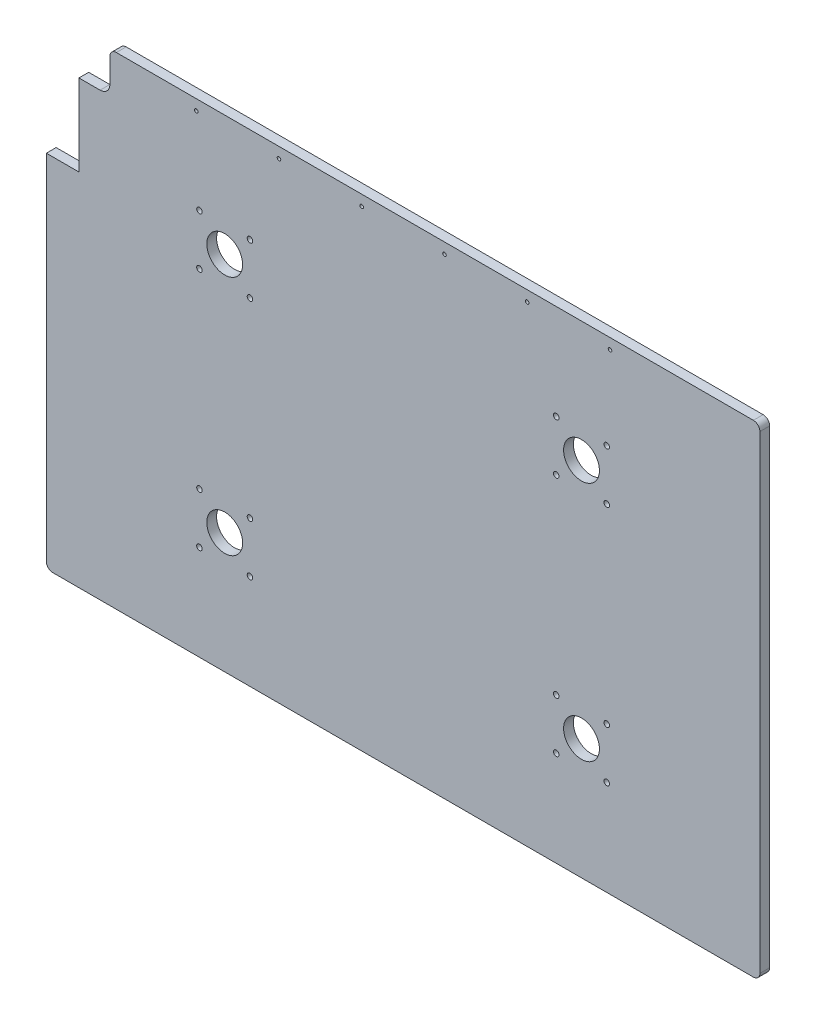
ISO-10303-21;
HEADER;
FILE_DESCRIPTION(('STEP AP214'),'2;1');
FILE_NAME('part.step','',(''),(''),'','','');
FILE_SCHEMA(('AUTOMOTIVE_DESIGN { 1 0 10303 214 1 1 1 1 }'));
ENDSEC;
DATA;
#1=APPLICATION_CONTEXT('core data for automotive mechanical design processes');
#2=APPLICATION_PROTOCOL_DEFINITION('international standard','automotive_design',2000,#1);
#3=PRODUCT_CONTEXT('',#1,'mechanical');
#4=PRODUCT('Part','Part','',(#3));
#5=PRODUCT_RELATED_PRODUCT_CATEGORY('part','',(#4));
#6=PRODUCT_DEFINITION_FORMATION('','',#4);
#7=PRODUCT_DEFINITION_CONTEXT('part definition',#1,'design');
#8=PRODUCT_DEFINITION('design','',#6,#7);
#9=PRODUCT_DEFINITION_SHAPE('','',#8);
#10=(LENGTH_UNIT() NAMED_UNIT(*) SI_UNIT(.MILLI.,.METRE.));
#11=(NAMED_UNIT(*) PLANE_ANGLE_UNIT() SI_UNIT($,.RADIAN.));
#12=(NAMED_UNIT(*) SI_UNIT($,.STERADIAN.) SOLID_ANGLE_UNIT());
#13=UNCERTAINTY_MEASURE_WITH_UNIT(LENGTH_MEASURE(1.E-05),#10,'distance_accuracy_value','');
#14=(GEOMETRIC_REPRESENTATION_CONTEXT(3) GLOBAL_UNCERTAINTY_ASSIGNED_CONTEXT((#13)) GLOBAL_UNIT_ASSIGNED_CONTEXT((#10,
#11,#12)) REPRESENTATION_CONTEXT('',''));
#15=CARTESIAN_POINT('',(0.,0.,0.));
#16=DIRECTION('',(0.,0.,1.));
#17=DIRECTION('',(1.,0.,0.));
#18=AXIS2_PLACEMENT_3D('',#15,#16,#17);
#19=CARTESIAN_POINT('',(-219.,143.5,72.));
#20=DIRECTION('',(0.,-1.,0.));
#21=DIRECTION('',(0.,0.,-1.));
#22=AXIS2_PLACEMENT_3D('',#19,#20,#21);
#23=PLANE('',#22);
#24=DIRECTION('',(-1.,0.,0.));
#25=VECTOR('',#24,1.);
#26=CARTESIAN_POINT('',(-219.,143.5,66.));
#27=LINE('',#26,#25);
#28=CARTESIAN_POINT('',(215.,143.5,66.));
#29=VERTEX_POINT('',#28);
#30=CARTESIAN_POINT('',(-176.,143.5,66.));
#31=VERTEX_POINT('',#30);
#32=EDGE_CURVE('E153',#29,#31,#27,.T.);
#33=ORIENTED_EDGE('',*,*,#32,.T.);
#34=DIRECTION('',(0.,0.,1.));
#35=VECTOR('',#34,1.);
#36=CARTESIAN_POINT('',(-176.,143.5,72.));
#37=LINE('',#36,#35);
#38=CARTESIAN_POINT('',(-176.,143.5,72.));
#39=VERTEX_POINT('',#38);
#40=EDGE_CURVE('E179',#31,#39,#37,.T.);
#41=ORIENTED_EDGE('',*,*,#40,.T.);
#42=DIRECTION('',(-1.,0.,0.));
#43=VECTOR('',#42,1.);
#44=CARTESIAN_POINT('',(-219.,143.5,72.));
#45=LINE('',#44,#43);
#46=CARTESIAN_POINT('',(215.,143.5,72.));
#47=VERTEX_POINT('',#46);
#48=EDGE_CURVE('E167',#47,#39,#45,.T.);
#49=ORIENTED_EDGE('',*,*,#48,.F.);
#50=DIRECTION('',(0.,0.,-1.));
#51=VECTOR('',#50,1.);
#52=CARTESIAN_POINT('',(215.,143.5,72.));
#53=LINE('',#52,#51);
#54=EDGE_CURVE('E170',#47,#29,#53,.T.);
#55=ORIENTED_EDGE('',*,*,#54,.T.);
#56=EDGE_LOOP('',(#33,#41,#49,#55));
#57=FACE_BOUND('',#56,.T.);
#58=ADVANCED_FACE('F35',(#57),#23,.F.);
#59=CARTESIAN_POINT('',(-219.,143.5,72.));
#60=DIRECTION('',(1.,0.,0.));
#61=DIRECTION('',(0.,1.,0.));
#62=AXIS2_PLACEMENT_3D('',#59,#60,#61);
#63=PLANE('',#62);
#64=DIRECTION('',(0.,-1.,0.));
#65=VECTOR('',#64,1.);
#66=CARTESIAN_POINT('',(-219.,143.5,72.));
#67=LINE('',#66,#65);
#68=CARTESIAN_POINT('',(-219.,68.4999999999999,72.));
#69=VERTEX_POINT('',#68);
#70=CARTESIAN_POINT('',(-219.,-148.5,72.));
#71=VERTEX_POINT('',#70);
#72=EDGE_CURVE('E145',#69,#71,#67,.T.);
#73=ORIENTED_EDGE('',*,*,#72,.F.);
#74=DIRECTION('',(0.,0.,1.));
#75=VECTOR('',#74,1.);
#76=CARTESIAN_POINT('',(-219.,68.4999999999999,65.999));
#77=LINE('',#76,#75);
#78=CARTESIAN_POINT('',(-219.,68.4999999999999,66.));
#79=VERTEX_POINT('',#78);
#80=EDGE_CURVE('E131',#79,#69,#77,.T.);
#81=ORIENTED_EDGE('',*,*,#80,.F.);
#82=DIRECTION('',(0.,-1.,0.));
#83=VECTOR('',#82,1.);
#84=CARTESIAN_POINT('',(-219.,143.5,66.));
#85=LINE('',#84,#83);
#86=CARTESIAN_POINT('',(-219.,-148.5,66.));
#87=VERTEX_POINT('',#86);
#88=EDGE_CURVE('E49',#79,#87,#85,.T.);
#89=ORIENTED_EDGE('',*,*,#88,.T.);
#90=DIRECTION('',(0.,0.,-1.));
#91=VECTOR('',#90,1.);
#92=CARTESIAN_POINT('',(-219.,-148.5,72.));
#93=LINE('',#92,#91);
#94=EDGE_CURVE('E11',#87,#71,#93,.F.);
#95=ORIENTED_EDGE('',*,*,#94,.T.);
#96=EDGE_LOOP('',(#73,#81,#89,#95));
#97=FACE_BOUND('',#96,.T.);
#98=ADVANCED_FACE('F149',(#97),#63,.F.);
#99=CARTESIAN_POINT('',(-219.,-152.5,72.));
#100=DIRECTION('',(0.,1.,0.));
#101=DIRECTION('',(0.,0.,1.));
#102=AXIS2_PLACEMENT_3D('',#99,#100,#101);
#103=PLANE('',#102);
#104=DIRECTION('',(1.,0.,0.));
#105=VECTOR('',#104,1.);
#106=CARTESIAN_POINT('',(-219.,-152.5,66.));
#107=LINE('',#106,#105);
#108=CARTESIAN_POINT('',(-215.,-152.5,66.));
#109=VERTEX_POINT('',#108);
#110=CARTESIAN_POINT('',(215.,-152.5,66.));
#111=VERTEX_POINT('',#110);
#112=EDGE_CURVE('E172',#109,#111,#107,.T.);
#113=ORIENTED_EDGE('',*,*,#112,.T.);
#114=DIRECTION('',(0.,0.,-1.));
#115=VECTOR('',#114,1.);
#116=CARTESIAN_POINT('',(215.,-152.5,72.));
#117=LINE('',#116,#115);
#118=CARTESIAN_POINT('',(215.,-152.5,72.));
#119=VERTEX_POINT('',#118);
#120=EDGE_CURVE('E43',#111,#119,#117,.F.);
#121=ORIENTED_EDGE('',*,*,#120,.T.);
#122=DIRECTION('',(1.,0.,0.));
#123=VECTOR('',#122,1.);
#124=CARTESIAN_POINT('',(-219.,-152.5,72.));
#125=LINE('',#124,#123);
#126=CARTESIAN_POINT('',(-215.,-152.5,72.));
#127=VERTEX_POINT('',#126);
#128=EDGE_CURVE('E152',#127,#119,#125,.T.);
#129=ORIENTED_EDGE('',*,*,#128,.F.);
#130=DIRECTION('',(0.,0.,-1.));
#131=VECTOR('',#130,1.);
#132=CARTESIAN_POINT('',(-215.,-152.5,72.));
#133=LINE('',#132,#131);
#134=EDGE_CURVE('E204',#127,#109,#133,.T.);
#135=ORIENTED_EDGE('',*,*,#134,.T.);
#136=EDGE_LOOP('',(#113,#121,#129,#135));
#137=FACE_BOUND('',#136,.T.);
#138=ADVANCED_FACE('F209',(#137),#103,.F.);
#139=CARTESIAN_POINT('',(219.,143.5,72.));
#140=DIRECTION('',(-1.,0.,0.));
#141=DIRECTION('',(0.,-1.,0.));
#142=AXIS2_PLACEMENT_3D('',#139,#140,#141);
#143=PLANE('',#142);
#144=DIRECTION('',(0.,1.,0.));
#145=VECTOR('',#144,1.);
#146=CARTESIAN_POINT('',(219.,143.5,66.));
#147=LINE('',#146,#145);
#148=CARTESIAN_POINT('',(219.,-148.5,66.));
#149=VERTEX_POINT('',#148);
#150=CARTESIAN_POINT('',(219.,139.5,66.));
#151=VERTEX_POINT('',#150);
#152=EDGE_CURVE('E159',#149,#151,#147,.T.);
#153=ORIENTED_EDGE('',*,*,#152,.T.);
#154=DIRECTION('',(0.,0.,-1.));
#155=VECTOR('',#154,1.);
#156=CARTESIAN_POINT('',(219.,139.5,72.));
#157=LINE('',#156,#155);
#158=CARTESIAN_POINT('',(219.,139.5,72.));
#159=VERTEX_POINT('',#158);
#160=EDGE_CURVE('E202',#151,#159,#157,.F.);
#161=ORIENTED_EDGE('',*,*,#160,.T.);
#162=DIRECTION('',(0.,1.,0.));
#163=VECTOR('',#162,1.);
#164=CARTESIAN_POINT('',(219.,143.5,72.));
#165=LINE('',#164,#163);
#166=CARTESIAN_POINT('',(219.,-148.5,72.));
#167=VERTEX_POINT('',#166);
#168=EDGE_CURVE('E156',#167,#159,#165,.T.);
#169=ORIENTED_EDGE('',*,*,#168,.F.);
#170=DIRECTION('',(0.,0.,-1.));
#171=VECTOR('',#170,1.);
#172=CARTESIAN_POINT('',(219.,-148.5,72.));
#173=LINE('',#172,#171);
#174=EDGE_CURVE('E199',#167,#149,#173,.T.);
#175=ORIENTED_EDGE('',*,*,#174,.T.);
#176=EDGE_LOOP('',(#153,#161,#169,#175));
#177=FACE_BOUND('',#176,.T.);
#178=ADVANCED_FACE('F217',(#177),#143,.F.);
#179=CARTESIAN_POINT('',(0.,0.,72.));
#180=DIRECTION('',(0.,0.,1.));
#181=DIRECTION('',(1.,0.,0.));
#182=AXIS2_PLACEMENT_3D('',#179,#180,#181);
#183=PLANE('',#182);
#184=DIRECTION('',(0.,1.,0.));
#185=VECTOR('',#184,1.);
#186=CARTESIAN_POINT('',(-199.,68.4999999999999,72.));
#187=LINE('',#186,#185);
#188=CARTESIAN_POINT('',(-199.,68.4999999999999,72.));
#189=VERTEX_POINT('',#188);
#190=CARTESIAN_POINT('',(-199.,118.5,72.));
#191=VERTEX_POINT('',#190);
#192=EDGE_CURVE('E140',#189,#191,#187,.T.);
#193=ORIENTED_EDGE('',*,*,#192,.F.);
#194=DIRECTION('',(1.,0.,0.));
#195=VECTOR('',#194,1.);
#196=CARTESIAN_POINT('',(-219.,68.4999999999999,72.));
#197=LINE('',#196,#195);
#198=EDGE_CURVE('E134',#69,#189,#197,.T.);
#199=ORIENTED_EDGE('',*,*,#198,.F.);
#200=ORIENTED_EDGE('',*,*,#72,.T.);
#201=CARTESIAN_POINT('',(-215.,-148.5,72.));
#202=DIRECTION('',(0.,0.,1.));
#203=DIRECTION('',(1.,0.,0.));
#204=AXIS2_PLACEMENT_3D('',#201,#202,#203);
#205=CIRCLE('',#204,4.);
#206=EDGE_CURVE('E182',#71,#127,#205,.T.);
#207=ORIENTED_EDGE('',*,*,#206,.T.);
#208=ORIENTED_EDGE('',*,*,#128,.T.);
#209=CARTESIAN_POINT('',(215.,-148.5,72.));
#210=DIRECTION('',(0.,0.,1.));
#211=DIRECTION('',(1.,0.,0.));
#212=AXIS2_PLACEMENT_3D('',#209,#210,#211);
#213=CIRCLE('',#212,4.);
#214=EDGE_CURVE('E184',#119,#167,#213,.T.);
#215=ORIENTED_EDGE('',*,*,#214,.T.);
#216=ORIENTED_EDGE('',*,*,#168,.T.);
#217=CARTESIAN_POINT('',(215.,139.5,72.));
#218=DIRECTION('',(0.,0.,1.));
#219=DIRECTION('',(1.,0.,0.));
#220=AXIS2_PLACEMENT_3D('',#217,#218,#219);
#221=CIRCLE('',#220,4.);
#222=EDGE_CURVE('E186',#159,#47,#221,.T.);
#223=ORIENTED_EDGE('',*,*,#222,.T.);
#224=ORIENTED_EDGE('',*,*,#48,.T.);
#225=CARTESIAN_POINT('',(-176.,139.5,72.));
#226=DIRECTION('',(0.,0.,1.));
#227=DIRECTION('',(1.,0.,0.));
#228=AXIS2_PLACEMENT_3D('',#225,#226,#227);
#229=CIRCLE('',#228,4.);
#230=CARTESIAN_POINT('',(-180.,139.5,72.));
#231=VERTEX_POINT('',#230);
#232=EDGE_CURVE('E188',#39,#231,#229,.T.);
#233=ORIENTED_EDGE('',*,*,#232,.T.);
#234=DIRECTION('',(0.,1.,0.));
#235=VECTOR('',#234,1.);
#236=CARTESIAN_POINT('',(-180.,124.5,72.));
#237=LINE('',#236,#235);
#238=CARTESIAN_POINT('',(-180.,124.5,72.));
#239=VERTEX_POINT('',#238);
#240=EDGE_CURVE('E231',#239,#231,#237,.T.);
#241=ORIENTED_EDGE('',*,*,#240,.F.);
#242=CARTESIAN_POINT('',(-186.,124.5,72.));
#243=DIRECTION('',(0.,0.,1.));
#244=DIRECTION('',(1.,0.,0.));
#245=AXIS2_PLACEMENT_3D('',#242,#243,#244);
#246=CIRCLE('',#245,6.);
#247=CARTESIAN_POINT('',(-186.,118.5,72.));
#248=VERTEX_POINT('',#247);
#249=EDGE_CURVE('E256',#248,#239,#246,.T.);
#250=ORIENTED_EDGE('',*,*,#249,.F.);
#251=DIRECTION('',(1.,0.,0.));
#252=VECTOR('',#251,1.);
#253=CARTESIAN_POINT('',(-199.,118.5,72.));
#254=LINE('',#253,#252);
#255=EDGE_CURVE('E240',#191,#248,#254,.T.);
#256=ORIENTED_EDGE('',*,*,#255,.F.);
#257=EDGE_LOOP('',(#193,#199,#200,#207,#208,#215,#216,#223,#224,#233,#241,#250,#256));
#258=FACE_BOUND('',#257,.T.);
#259=CARTESIAN_POINT('',(-127.,136.97474,72.));
#260=DIRECTION('',(0.,0.,-1.));
#261=DIRECTION('',(-1.,0.,0.));
#262=AXIS2_PLACEMENT_3D('',#259,#260,#261);
#263=CIRCLE('',#262,1.09999999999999);
#264=CARTESIAN_POINT('',(-128.1,136.97474,72.));
#265=VERTEX_POINT('',#264);
#266=EDGE_CURVE('E265',#265,#265,#263,.T.);
#267=ORIENTED_EDGE('',*,*,#266,.T.);
#268=EDGE_LOOP('',(#267));
#269=FACE_BOUND('',#268,.T.);
#270=CARTESIAN_POINT('',(-76.2,136.97474,72.));
#271=DIRECTION('',(0.,0.,-1.));
#272=DIRECTION('',(-1.,0.,0.));
#273=AXIS2_PLACEMENT_3D('',#270,#271,#272);
#274=CIRCLE('',#273,1.1);
#275=CARTESIAN_POINT('',(-77.3,136.97474,72.));
#276=VERTEX_POINT('',#275);
#277=EDGE_CURVE('E272',#276,#276,#274,.T.);
#278=ORIENTED_EDGE('',*,*,#277,.T.);
#279=EDGE_LOOP('',(#278));
#280=FACE_BOUND('',#279,.T.);
#281=CARTESIAN_POINT('',(-25.4,136.97474,72.));
#282=DIRECTION('',(0.,0.,-1.));
#283=DIRECTION('',(-1.,0.,0.));
#284=AXIS2_PLACEMENT_3D('',#281,#282,#283);
#285=CIRCLE('',#284,1.09999999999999);
#286=CARTESIAN_POINT('',(-26.5,136.97474,72.));
#287=VERTEX_POINT('',#286);
#288=EDGE_CURVE('E278',#287,#287,#285,.T.);
#289=ORIENTED_EDGE('',*,*,#288,.T.);
#290=EDGE_LOOP('',(#289));
#291=FACE_BOUND('',#290,.T.);
#292=CARTESIAN_POINT('',(25.4,136.97474,72.));
#293=DIRECTION('',(0.,0.,-1.));
#294=DIRECTION('',(-1.,0.,0.));
#295=AXIS2_PLACEMENT_3D('',#292,#293,#294);
#296=CIRCLE('',#295,1.09999999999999);
#297=CARTESIAN_POINT('',(24.3,136.97474,72.));
#298=VERTEX_POINT('',#297);
#299=EDGE_CURVE('E284',#298,#298,#296,.T.);
#300=ORIENTED_EDGE('',*,*,#299,.T.);
#301=EDGE_LOOP('',(#300));
#302=FACE_BOUND('',#301,.T.);
#303=CARTESIAN_POINT('',(76.2,136.97474,72.));
#304=DIRECTION('',(0.,0.,-1.));
#305=DIRECTION('',(-1.,0.,0.));
#306=AXIS2_PLACEMENT_3D('',#303,#304,#305);
#307=CIRCLE('',#306,1.1);
#308=CARTESIAN_POINT('',(75.1,136.97474,72.));
#309=VERTEX_POINT('',#308);
#310=EDGE_CURVE('E290',#309,#309,#307,.T.);
#311=ORIENTED_EDGE('',*,*,#310,.T.);
#312=EDGE_LOOP('',(#311));
#313=FACE_BOUND('',#312,.T.);
#314=CARTESIAN_POINT('',(127.,136.97474,72.));
#315=DIRECTION('',(0.,0.,-1.));
#316=DIRECTION('',(-1.,0.,0.));
#317=AXIS2_PLACEMENT_3D('',#314,#315,#316);
#318=CIRCLE('',#317,1.09999999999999);
#319=CARTESIAN_POINT('',(125.9,136.97474,72.));
#320=VERTEX_POINT('',#319);
#321=EDGE_CURVE('E296',#320,#320,#318,.T.);
#322=ORIENTED_EDGE('',*,*,#321,.T.);
#323=EDGE_LOOP('',(#322));
#324=FACE_BOUND('',#323,.T.);
#325=CARTESIAN_POINT('',(125.,53.9999999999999,72.));
#326=DIRECTION('',(0.,0.,1.));
#327=DIRECTION('',(1.,0.,0.));
#328=AXIS2_PLACEMENT_3D('',#325,#326,#327);
#329=CIRCLE('',#328,1.69999999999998);
#330=CARTESIAN_POINT('',(126.7,53.9999999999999,72.));
#331=VERTEX_POINT('',#330);
#332=EDGE_CURVE('E322',#331,#331,#329,.T.);
#333=ORIENTED_EDGE('',*,*,#332,.F.);
#334=EDGE_LOOP('',(#333));
#335=FACE_BOUND('',#334,.T.);
#336=CARTESIAN_POINT('',(94.,53.9999999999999,72.));
#337=DIRECTION('',(0.,0.,1.));
#338=DIRECTION('',(1.,0.,0.));
#339=AXIS2_PLACEMENT_3D('',#336,#337,#338);
#340=CIRCLE('',#339,1.7);
#341=CARTESIAN_POINT('',(95.7,53.9999999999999,72.));
#342=VERTEX_POINT('',#341);
#343=EDGE_CURVE('E347',#342,#342,#340,.T.);
#344=ORIENTED_EDGE('',*,*,#343,.F.);
#345=EDGE_LOOP('',(#344));
#346=FACE_BOUND('',#345,.T.);
#347=CARTESIAN_POINT('',(109.5,69.4999999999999,72.));
#348=DIRECTION('',(0.,0.,1.));
#349=DIRECTION('',(1.,0.,0.));
#350=AXIS2_PLACEMENT_3D('',#347,#348,#349);
#351=CIRCLE('',#350,11.);
#352=CARTESIAN_POINT('',(120.5,69.4999999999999,72.));
#353=VERTEX_POINT('',#352);
#354=EDGE_CURVE('E346',#353,#353,#351,.T.);
#355=ORIENTED_EDGE('',*,*,#354,.F.);
#356=EDGE_LOOP('',(#355));
#357=FACE_BOUND('',#356,.T.);
#358=CARTESIAN_POINT('',(125.,-63.0000000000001,72.));
#359=DIRECTION('',(0.,0.,1.));
#360=DIRECTION('',(1.,0.,0.));
#361=AXIS2_PLACEMENT_3D('',#358,#359,#360);
#362=CIRCLE('',#361,1.69999999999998);
#363=CARTESIAN_POINT('',(126.7,-63.0000000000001,72.));
#364=VERTEX_POINT('',#363);
#365=EDGE_CURVE('E359',#364,#364,#362,.T.);
#366=ORIENTED_EDGE('',*,*,#365,.F.);
#367=EDGE_LOOP('',(#366));
#368=FACE_BOUND('',#367,.T.);
#369=CARTESIAN_POINT('',(94.,84.9999999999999,72.));
#370=DIRECTION('',(0.,0.,1.));
#371=DIRECTION('',(1.,0.,0.));
#372=AXIS2_PLACEMENT_3D('',#369,#370,#371);
#373=CIRCLE('',#372,1.7);
#374=CARTESIAN_POINT('',(95.7,84.9999999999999,72.));
#375=VERTEX_POINT('',#374);
#376=EDGE_CURVE('E323',#375,#375,#373,.T.);
#377=ORIENTED_EDGE('',*,*,#376,.F.);
#378=EDGE_LOOP('',(#377));
#379=FACE_BOUND('',#378,.T.);
#380=CARTESIAN_POINT('',(125.,84.9999999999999,72.));
#381=DIRECTION('',(0.,0.,1.));
#382=DIRECTION('',(1.,0.,0.));
#383=AXIS2_PLACEMENT_3D('',#380,#381,#382);
#384=CIRCLE('',#383,1.69999999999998);
#385=CARTESIAN_POINT('',(126.7,84.9999999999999,72.));
#386=VERTEX_POINT('',#385);
#387=EDGE_CURVE('E329',#386,#386,#384,.T.);
#388=ORIENTED_EDGE('',*,*,#387,.F.);
#389=EDGE_LOOP('',(#388));
#390=FACE_BOUND('',#389,.T.);
#391=CARTESIAN_POINT('',(-109.5,69.4999999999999,72.));
#392=DIRECTION('',(0.,0.,1.));
#393=DIRECTION('',(1.,0.,0.));
#394=AXIS2_PLACEMENT_3D('',#391,#392,#393);
#395=CIRCLE('',#394,11.);
#396=CARTESIAN_POINT('',(-98.5,69.4999999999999,72.));
#397=VERTEX_POINT('',#396);
#398=EDGE_CURVE('E335',#397,#397,#395,.T.);
#399=ORIENTED_EDGE('',*,*,#398,.F.);
#400=EDGE_LOOP('',(#399));
#401=FACE_BOUND('',#400,.T.);
#402=CARTESIAN_POINT('',(-125.,53.9999999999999,72.));
#403=DIRECTION('',(0.,0.,1.));
#404=DIRECTION('',(1.,0.,0.));
#405=AXIS2_PLACEMENT_3D('',#402,#403,#404);
#406=CIRCLE('',#405,1.7);
#407=CARTESIAN_POINT('',(-123.3,53.9999999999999,72.));
#408=VERTEX_POINT('',#407);
#409=EDGE_CURVE('E310',#408,#408,#406,.T.);
#410=ORIENTED_EDGE('',*,*,#409,.F.);
#411=EDGE_LOOP('',(#410));
#412=FACE_BOUND('',#411,.T.);
#413=CARTESIAN_POINT('',(109.5,-78.5000000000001,72.));
#414=DIRECTION('',(0.,0.,1.));
#415=DIRECTION('',(1.,0.,0.));
#416=AXIS2_PLACEMENT_3D('',#413,#414,#415);
#417=CIRCLE('',#416,11.);
#418=CARTESIAN_POINT('',(120.5,-78.5000000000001,72.));
#419=VERTEX_POINT('',#418);
#420=EDGE_CURVE('E383',#419,#419,#417,.T.);
#421=ORIENTED_EDGE('',*,*,#420,.F.);
#422=EDGE_LOOP('',(#421));
#423=FACE_BOUND('',#422,.T.);
#424=CARTESIAN_POINT('',(94.,-94.0000000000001,72.));
#425=DIRECTION('',(0.,0.,1.));
#426=DIRECTION('',(1.,0.,0.));
#427=AXIS2_PLACEMENT_3D('',#424,#425,#426);
#428=CIRCLE('',#427,1.7);
#429=CARTESIAN_POINT('',(95.7,-94.0000000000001,72.));
#430=VERTEX_POINT('',#429);
#431=EDGE_CURVE('E370',#430,#430,#428,.T.);
#432=ORIENTED_EDGE('',*,*,#431,.F.);
#433=EDGE_LOOP('',(#432));
#434=FACE_BOUND('',#433,.T.);
#435=CARTESIAN_POINT('',(125.,-94.0000000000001,72.));
#436=DIRECTION('',(0.,0.,1.));
#437=DIRECTION('',(1.,0.,0.));
#438=AXIS2_PLACEMENT_3D('',#435,#436,#437);
#439=CIRCLE('',#438,1.69999999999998);
#440=CARTESIAN_POINT('',(126.7,-94.0000000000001,72.));
#441=VERTEX_POINT('',#440);
#442=EDGE_CURVE('E371',#441,#441,#439,.T.);
#443=ORIENTED_EDGE('',*,*,#442,.F.);
#444=EDGE_LOOP('',(#443));
#445=FACE_BOUND('',#444,.T.);
#446=CARTESIAN_POINT('',(94.,-63.0000000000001,72.));
#447=DIRECTION('',(0.,0.,1.));
#448=DIRECTION('',(1.,0.,0.));
#449=AXIS2_PLACEMENT_3D('',#446,#447,#448);
#450=CIRCLE('',#449,1.7);
#451=CARTESIAN_POINT('',(95.7,-63.0000000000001,72.));
#452=VERTEX_POINT('',#451);
#453=EDGE_CURVE('E358',#452,#452,#450,.T.);
#454=ORIENTED_EDGE('',*,*,#453,.F.);
#455=EDGE_LOOP('',(#454));
#456=FACE_BOUND('',#455,.T.);
#457=CARTESIAN_POINT('',(-94.,84.9999999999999,72.));
#458=DIRECTION('',(0.,0.,1.));
#459=DIRECTION('',(1.,0.,0.));
#460=AXIS2_PLACEMENT_3D('',#457,#458,#459);
#461=CIRCLE('',#460,1.69999999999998);
#462=CARTESIAN_POINT('',(-92.3000000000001,84.9999999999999,72.));
#463=VERTEX_POINT('',#462);
#464=EDGE_CURVE('E268',#463,#463,#461,.T.);
#465=ORIENTED_EDGE('',*,*,#464,.F.);
#466=EDGE_LOOP('',(#465));
#467=FACE_BOUND('',#466,.T.);
#468=CARTESIAN_POINT('',(-125.,84.9999999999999,72.));
#469=DIRECTION('',(0.,0.,1.));
#470=DIRECTION('',(1.,0.,0.));
#471=AXIS2_PLACEMENT_3D('',#468,#469,#470);
#472=CIRCLE('',#471,1.7);
#473=CARTESIAN_POINT('',(-123.3,84.9999999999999,72.));
#474=VERTEX_POINT('',#473);
#475=EDGE_CURVE('E304',#474,#474,#472,.T.);
#476=ORIENTED_EDGE('',*,*,#475,.F.);
#477=EDGE_LOOP('',(#476));
#478=FACE_BOUND('',#477,.T.);
#479=CARTESIAN_POINT('',(-94.,53.9999999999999,72.));
#480=DIRECTION('',(0.,0.,1.));
#481=DIRECTION('',(1.,0.,0.));
#482=AXIS2_PLACEMENT_3D('',#479,#480,#481);
#483=CIRCLE('',#482,1.69999999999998);
#484=CARTESIAN_POINT('',(-92.3000000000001,53.9999999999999,72.));
#485=VERTEX_POINT('',#484);
#486=EDGE_CURVE('E311',#485,#485,#483,.T.);
#487=ORIENTED_EDGE('',*,*,#486,.F.);
#488=EDGE_LOOP('',(#487));
#489=FACE_BOUND('',#488,.T.);
#490=CARTESIAN_POINT('',(-94.,-63.0000000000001,72.));
#491=DIRECTION('',(0.,0.,1.));
#492=DIRECTION('',(1.,0.,0.));
#493=AXIS2_PLACEMENT_3D('',#490,#491,#492);
#494=CIRCLE('',#493,1.69999999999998);
#495=CARTESIAN_POINT('',(-92.3,-63.0000000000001,72.));
#496=VERTEX_POINT('',#495);
#497=EDGE_CURVE('E382',#496,#496,#494,.T.);
#498=ORIENTED_EDGE('',*,*,#497,.F.);
#499=EDGE_LOOP('',(#498));
#500=FACE_BOUND('',#499,.T.);
#501=CARTESIAN_POINT('',(-125.,-63.0000000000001,72.));
#502=DIRECTION('',(0.,0.,1.));
#503=DIRECTION('',(1.,0.,0.));
#504=AXIS2_PLACEMENT_3D('',#501,#502,#503);
#505=CIRCLE('',#504,1.7);
#506=CARTESIAN_POINT('',(-123.3,-63.0000000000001,72.));
#507=VERTEX_POINT('',#506);
#508=EDGE_CURVE('E406',#507,#507,#505,.T.);
#509=ORIENTED_EDGE('',*,*,#508,.F.);
#510=EDGE_LOOP('',(#509));
#511=FACE_BOUND('',#510,.T.);
#512=CARTESIAN_POINT('',(-94.,-94.0000000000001,72.));
#513=DIRECTION('',(0.,0.,1.));
#514=DIRECTION('',(1.,0.,0.));
#515=AXIS2_PLACEMENT_3D('',#512,#513,#514);
#516=CIRCLE('',#515,1.69999999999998);
#517=CARTESIAN_POINT('',(-92.3,-94.0000000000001,72.));
#518=VERTEX_POINT('',#517);
#519=EDGE_CURVE('E400',#518,#518,#516,.T.);
#520=ORIENTED_EDGE('',*,*,#519,.F.);
#521=EDGE_LOOP('',(#520));
#522=FACE_BOUND('',#521,.T.);
#523=CARTESIAN_POINT('',(-125.,-94.0000000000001,72.));
#524=DIRECTION('',(0.,0.,1.));
#525=DIRECTION('',(1.,0.,0.));
#526=AXIS2_PLACEMENT_3D('',#523,#524,#525);
#527=CIRCLE('',#526,1.7);
#528=CARTESIAN_POINT('',(-123.3,-94.0000000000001,72.));
#529=VERTEX_POINT('',#528);
#530=EDGE_CURVE('E394',#529,#529,#527,.T.);
#531=ORIENTED_EDGE('',*,*,#530,.F.);
#532=EDGE_LOOP('',(#531));
#533=FACE_BOUND('',#532,.T.);
#534=CARTESIAN_POINT('',(-109.5,-78.5000000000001,72.));
#535=DIRECTION('',(0.,0.,1.));
#536=DIRECTION('',(1.,0.,0.));
#537=AXIS2_PLACEMENT_3D('',#534,#535,#536);
#538=CIRCLE('',#537,11.);
#539=CARTESIAN_POINT('',(-98.5,-78.5000000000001,72.));
#540=VERTEX_POINT('',#539);
#541=EDGE_CURVE('E162',#540,#540,#538,.T.);
#542=ORIENTED_EDGE('',*,*,#541,.F.);
#543=EDGE_LOOP('',(#542));
#544=FACE_BOUND('',#543,.T.);
#545=ADVANCED_FACE('F143',(#258,#269,#280,#291,#302,#313,#324,#335,#346,#357,#368,#379,#390,
#401,#412,#423,#434,#445,#456,#467,#478,#489,#500,#511,#522,#533,#544),#183,.T.);
#546=CARTESIAN_POINT('',(0.,0.,66.));
#547=DIRECTION('',(0.,0.,1.));
#548=DIRECTION('',(1.,0.,0.));
#549=AXIS2_PLACEMENT_3D('',#546,#547,#548);
#550=PLANE('',#549);
#551=CARTESIAN_POINT('',(-127.,136.97474,66.));
#552=DIRECTION('',(0.,0.,-1.));
#553=DIRECTION('',(-1.,0.,0.));
#554=AXIS2_PLACEMENT_3D('',#551,#552,#553);
#555=CIRCLE('',#554,1.09999999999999);
#556=CARTESIAN_POINT('',(-128.1,136.97474,66.));
#557=VERTEX_POINT('',#556);
#558=EDGE_CURVE('E269',#557,#557,#555,.T.);
#559=ORIENTED_EDGE('',*,*,#558,.F.);
#560=EDGE_LOOP('',(#559));
#561=FACE_BOUND('',#560,.T.);
#562=CARTESIAN_POINT('',(-76.2,136.97474,66.));
#563=DIRECTION('',(0.,0.,-1.));
#564=DIRECTION('',(-1.,0.,0.));
#565=AXIS2_PLACEMENT_3D('',#562,#563,#564);
#566=CIRCLE('',#565,1.1);
#567=CARTESIAN_POINT('',(-77.3,136.97474,66.));
#568=VERTEX_POINT('',#567);
#569=EDGE_CURVE('E275',#568,#568,#566,.T.);
#570=ORIENTED_EDGE('',*,*,#569,.F.);
#571=EDGE_LOOP('',(#570));
#572=FACE_BOUND('',#571,.T.);
#573=CARTESIAN_POINT('',(-25.4,136.97474,66.));
#574=DIRECTION('',(0.,0.,-1.));
#575=DIRECTION('',(-1.,0.,0.));
#576=AXIS2_PLACEMENT_3D('',#573,#574,#575);
#577=CIRCLE('',#576,1.09999999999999);
#578=CARTESIAN_POINT('',(-26.5,136.97474,66.));
#579=VERTEX_POINT('',#578);
#580=EDGE_CURVE('E281',#579,#579,#577,.T.);
#581=ORIENTED_EDGE('',*,*,#580,.F.);
#582=EDGE_LOOP('',(#581));
#583=FACE_BOUND('',#582,.T.);
#584=CARTESIAN_POINT('',(25.4,136.97474,66.));
#585=DIRECTION('',(0.,0.,-1.));
#586=DIRECTION('',(-1.,0.,0.));
#587=AXIS2_PLACEMENT_3D('',#584,#585,#586);
#588=CIRCLE('',#587,1.09999999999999);
#589=CARTESIAN_POINT('',(24.3,136.97474,66.));
#590=VERTEX_POINT('',#589);
#591=EDGE_CURVE('E287',#590,#590,#588,.T.);
#592=ORIENTED_EDGE('',*,*,#591,.F.);
#593=EDGE_LOOP('',(#592));
#594=FACE_BOUND('',#593,.T.);
#595=CARTESIAN_POINT('',(76.2,136.97474,66.));
#596=DIRECTION('',(0.,0.,-1.));
#597=DIRECTION('',(-1.,0.,0.));
#598=AXIS2_PLACEMENT_3D('',#595,#596,#597);
#599=CIRCLE('',#598,1.1);
#600=CARTESIAN_POINT('',(75.1,136.97474,66.));
#601=VERTEX_POINT('',#600);
#602=EDGE_CURVE('E293',#601,#601,#599,.T.);
#603=ORIENTED_EDGE('',*,*,#602,.F.);
#604=EDGE_LOOP('',(#603));
#605=FACE_BOUND('',#604,.T.);
#606=CARTESIAN_POINT('',(127.,136.97474,66.));
#607=DIRECTION('',(0.,0.,-1.));
#608=DIRECTION('',(-1.,0.,0.));
#609=AXIS2_PLACEMENT_3D('',#606,#607,#608);
#610=CIRCLE('',#609,1.09999999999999);
#611=CARTESIAN_POINT('',(125.9,136.97474,66.));
#612=VERTEX_POINT('',#611);
#613=EDGE_CURVE('E260',#612,#612,#610,.T.);
#614=ORIENTED_EDGE('',*,*,#613,.F.);
#615=EDGE_LOOP('',(#614));
#616=FACE_BOUND('',#615,.T.);
#617=CARTESIAN_POINT('',(125.,53.9999999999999,66.));
#618=DIRECTION('',(0.,0.,1.));
#619=DIRECTION('',(1.,0.,0.));
#620=AXIS2_PLACEMENT_3D('',#617,#618,#619);
#621=CIRCLE('',#620,1.69999999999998);
#622=CARTESIAN_POINT('',(126.7,53.9999999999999,66.));
#623=VERTEX_POINT('',#622);
#624=EDGE_CURVE('E350',#623,#623,#621,.T.);
#625=ORIENTED_EDGE('',*,*,#624,.T.);
#626=EDGE_LOOP('',(#625));
#627=FACE_BOUND('',#626,.T.);
#628=CARTESIAN_POINT('',(94.,53.9999999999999,66.));
#629=DIRECTION('',(0.,0.,1.));
#630=DIRECTION('',(1.,0.,0.));
#631=AXIS2_PLACEMENT_3D('',#628,#629,#630);
#632=CIRCLE('',#631,1.7);
#633=CARTESIAN_POINT('',(95.7,53.9999999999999,66.));
#634=VERTEX_POINT('',#633);
#635=EDGE_CURVE('E343',#634,#634,#632,.T.);
#636=ORIENTED_EDGE('',*,*,#635,.T.);
#637=EDGE_LOOP('',(#636));
#638=FACE_BOUND('',#637,.T.);
#639=CARTESIAN_POINT('',(109.5,69.4999999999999,66.));
#640=DIRECTION('',(0.,0.,1.));
#641=DIRECTION('',(1.,0.,0.));
#642=AXIS2_PLACEMENT_3D('',#639,#640,#641);
#643=CIRCLE('',#642,11.);
#644=CARTESIAN_POINT('',(120.5,69.4999999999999,66.));
#645=VERTEX_POINT('',#644);
#646=EDGE_CURVE('E362',#645,#645,#643,.T.);
#647=ORIENTED_EDGE('',*,*,#646,.T.);
#648=EDGE_LOOP('',(#647));
#649=FACE_BOUND('',#648,.T.);
#650=CARTESIAN_POINT('',(125.,-63.0000000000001,66.));
#651=DIRECTION('',(0.,0.,1.));
#652=DIRECTION('',(1.,0.,0.));
#653=AXIS2_PLACEMENT_3D('',#650,#651,#652);
#654=CIRCLE('',#653,1.69999999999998);
#655=CARTESIAN_POINT('',(126.7,-63.0000000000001,66.));
#656=VERTEX_POINT('',#655);
#657=EDGE_CURVE('E355',#656,#656,#654,.T.);
#658=ORIENTED_EDGE('',*,*,#657,.T.);
#659=EDGE_LOOP('',(#658));
#660=FACE_BOUND('',#659,.T.);
#661=CARTESIAN_POINT('',(94.,84.9999999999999,66.));
#662=DIRECTION('',(0.,0.,1.));
#663=DIRECTION('',(1.,0.,0.));
#664=AXIS2_PLACEMENT_3D('',#661,#662,#663);
#665=CIRCLE('',#664,1.7);
#666=CARTESIAN_POINT('',(95.7,84.9999999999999,66.));
#667=VERTEX_POINT('',#666);
#668=EDGE_CURVE('E319',#667,#667,#665,.T.);
#669=ORIENTED_EDGE('',*,*,#668,.T.);
#670=EDGE_LOOP('',(#669));
#671=FACE_BOUND('',#670,.T.);
#672=CARTESIAN_POINT('',(125.,84.9999999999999,66.));
#673=DIRECTION('',(0.,0.,1.));
#674=DIRECTION('',(1.,0.,0.));
#675=AXIS2_PLACEMENT_3D('',#672,#673,#674);
#676=CIRCLE('',#675,1.69999999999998);
#677=CARTESIAN_POINT('',(126.7,84.9999999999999,66.));
#678=VERTEX_POINT('',#677);
#679=EDGE_CURVE('E326',#678,#678,#676,.T.);
#680=ORIENTED_EDGE('',*,*,#679,.T.);
#681=EDGE_LOOP('',(#680));
#682=FACE_BOUND('',#681,.T.);
#683=CARTESIAN_POINT('',(-109.5,69.4999999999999,66.));
#684=DIRECTION('',(0.,0.,1.));
#685=DIRECTION('',(1.,0.,0.));
#686=AXIS2_PLACEMENT_3D('',#683,#684,#685);
#687=CIRCLE('',#686,11.);
#688=CARTESIAN_POINT('',(-98.5,69.4999999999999,66.));
#689=VERTEX_POINT('',#688);
#690=EDGE_CURVE('E332',#689,#689,#687,.T.);
#691=ORIENTED_EDGE('',*,*,#690,.T.);
#692=EDGE_LOOP('',(#691));
#693=FACE_BOUND('',#692,.T.);
#694=CARTESIAN_POINT('',(-125.,53.9999999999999,66.));
#695=DIRECTION('',(0.,0.,1.));
#696=DIRECTION('',(1.,0.,0.));
#697=AXIS2_PLACEMENT_3D('',#694,#695,#696);
#698=CIRCLE('',#697,1.7);
#699=CARTESIAN_POINT('',(-123.3,53.9999999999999,66.));
#700=VERTEX_POINT('',#699);
#701=EDGE_CURVE('E338',#700,#700,#698,.T.);
#702=ORIENTED_EDGE('',*,*,#701,.T.);
#703=EDGE_LOOP('',(#702));
#704=FACE_BOUND('',#703,.T.);
#705=CARTESIAN_POINT('',(109.5,-78.5000000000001,66.));
#706=DIRECTION('',(0.,0.,1.));
#707=DIRECTION('',(1.,0.,0.));
#708=AXIS2_PLACEMENT_3D('',#705,#706,#707);
#709=CIRCLE('',#708,11.);
#710=CARTESIAN_POINT('',(120.5,-78.5000000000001,66.));
#711=VERTEX_POINT('',#710);
#712=EDGE_CURVE('E379',#711,#711,#709,.T.);
#713=ORIENTED_EDGE('',*,*,#712,.T.);
#714=EDGE_LOOP('',(#713));
#715=FACE_BOUND('',#714,.T.);
#716=CARTESIAN_POINT('',(94.,-94.0000000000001,66.));
#717=DIRECTION('',(0.,0.,1.));
#718=DIRECTION('',(1.,0.,0.));
#719=AXIS2_PLACEMENT_3D('',#716,#717,#718);
#720=CIRCLE('',#719,1.7);
#721=CARTESIAN_POINT('',(95.7,-94.0000000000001,66.));
#722=VERTEX_POINT('',#721);
#723=EDGE_CURVE('E386',#722,#722,#720,.T.);
#724=ORIENTED_EDGE('',*,*,#723,.T.);
#725=EDGE_LOOP('',(#724));
#726=FACE_BOUND('',#725,.T.);
#727=CARTESIAN_POINT('',(125.,-94.0000000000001,66.));
#728=DIRECTION('',(0.,0.,1.));
#729=DIRECTION('',(1.,0.,0.));
#730=AXIS2_PLACEMENT_3D('',#727,#728,#729);
#731=CIRCLE('',#730,1.69999999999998);
#732=CARTESIAN_POINT('',(126.7,-94.0000000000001,66.));
#733=VERTEX_POINT('',#732);
#734=EDGE_CURVE('E367',#733,#733,#731,.T.);
#735=ORIENTED_EDGE('',*,*,#734,.T.);
#736=EDGE_LOOP('',(#735));
#737=FACE_BOUND('',#736,.T.);
#738=CARTESIAN_POINT('',(94.,-63.0000000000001,66.));
#739=DIRECTION('',(0.,0.,1.));
#740=DIRECTION('',(1.,0.,0.));
#741=AXIS2_PLACEMENT_3D('',#738,#739,#740);
#742=CIRCLE('',#741,1.7);
#743=CARTESIAN_POINT('',(95.7,-63.0000000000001,66.));
#744=VERTEX_POINT('',#743);
#745=EDGE_CURVE('E374',#744,#744,#742,.T.);
#746=ORIENTED_EDGE('',*,*,#745,.T.);
#747=EDGE_LOOP('',(#746));
#748=FACE_BOUND('',#747,.T.);
#749=CARTESIAN_POINT('',(-94.,84.9999999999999,66.));
#750=DIRECTION('',(0.,0.,1.));
#751=DIRECTION('',(1.,0.,0.));
#752=AXIS2_PLACEMENT_3D('',#749,#750,#751);
#753=CIRCLE('',#752,1.69999999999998);
#754=CARTESIAN_POINT('',(-92.3000000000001,84.9999999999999,66.));
#755=VERTEX_POINT('',#754);
#756=EDGE_CURVE('E301',#755,#755,#753,.T.);
#757=ORIENTED_EDGE('',*,*,#756,.T.);
#758=EDGE_LOOP('',(#757));
#759=FACE_BOUND('',#758,.T.);
#760=CARTESIAN_POINT('',(-125.,84.9999999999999,66.));
#761=DIRECTION('',(0.,0.,1.));
#762=DIRECTION('',(1.,0.,0.));
#763=AXIS2_PLACEMENT_3D('',#760,#761,#762);
#764=CIRCLE('',#763,1.7);
#765=CARTESIAN_POINT('',(-123.3,84.9999999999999,66.));
#766=VERTEX_POINT('',#765);
#767=EDGE_CURVE('E314',#766,#766,#764,.T.);
#768=ORIENTED_EDGE('',*,*,#767,.T.);
#769=EDGE_LOOP('',(#768));
#770=FACE_BOUND('',#769,.T.);
#771=CARTESIAN_POINT('',(-94.,53.9999999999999,66.));
#772=DIRECTION('',(0.,0.,1.));
#773=DIRECTION('',(1.,0.,0.));
#774=AXIS2_PLACEMENT_3D('',#771,#772,#773);
#775=CIRCLE('',#774,1.69999999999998);
#776=CARTESIAN_POINT('',(-92.3000000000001,53.9999999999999,66.));
#777=VERTEX_POINT('',#776);
#778=EDGE_CURVE('E307',#777,#777,#775,.T.);
#779=ORIENTED_EDGE('',*,*,#778,.T.);
#780=EDGE_LOOP('',(#779));
#781=FACE_BOUND('',#780,.T.);
#782=CARTESIAN_POINT('',(-94.,-63.0000000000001,66.));
#783=DIRECTION('',(0.,0.,1.));
#784=DIRECTION('',(1.,0.,0.));
#785=AXIS2_PLACEMENT_3D('',#782,#783,#784);
#786=CIRCLE('',#785,1.69999999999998);
#787=CARTESIAN_POINT('',(-92.3,-63.0000000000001,66.));
#788=VERTEX_POINT('',#787);
#789=EDGE_CURVE('E409',#788,#788,#786,.T.);
#790=ORIENTED_EDGE('',*,*,#789,.T.);
#791=EDGE_LOOP('',(#790));
#792=FACE_BOUND('',#791,.T.);
#793=CARTESIAN_POINT('',(-125.,-63.0000000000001,66.));
#794=DIRECTION('',(0.,0.,1.));
#795=DIRECTION('',(1.,0.,0.));
#796=AXIS2_PLACEMENT_3D('',#793,#794,#795);
#797=CIRCLE('',#796,1.7);
#798=CARTESIAN_POINT('',(-123.3,-63.0000000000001,66.));
#799=VERTEX_POINT('',#798);
#800=EDGE_CURVE('E403',#799,#799,#797,.T.);
#801=ORIENTED_EDGE('',*,*,#800,.T.);
#802=EDGE_LOOP('',(#801));
#803=FACE_BOUND('',#802,.T.);
#804=CARTESIAN_POINT('',(-94.,-94.0000000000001,66.));
#805=DIRECTION('',(0.,0.,1.));
#806=DIRECTION('',(1.,0.,0.));
#807=AXIS2_PLACEMENT_3D('',#804,#805,#806);
#808=CIRCLE('',#807,1.69999999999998);
#809=CARTESIAN_POINT('',(-92.3,-94.0000000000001,66.));
#810=VERTEX_POINT('',#809);
#811=EDGE_CURVE('E397',#810,#810,#808,.T.);
#812=ORIENTED_EDGE('',*,*,#811,.T.);
#813=EDGE_LOOP('',(#812));
#814=FACE_BOUND('',#813,.T.);
#815=CARTESIAN_POINT('',(-125.,-94.0000000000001,66.));
#816=DIRECTION('',(0.,0.,1.));
#817=DIRECTION('',(1.,0.,0.));
#818=AXIS2_PLACEMENT_3D('',#815,#816,#817);
#819=CIRCLE('',#818,1.7);
#820=CARTESIAN_POINT('',(-123.3,-94.0000000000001,66.));
#821=VERTEX_POINT('',#820);
#822=EDGE_CURVE('E391',#821,#821,#819,.T.);
#823=ORIENTED_EDGE('',*,*,#822,.T.);
#824=EDGE_LOOP('',(#823));
#825=FACE_BOUND('',#824,.T.);
#826=CARTESIAN_POINT('',(-109.5,-78.5000000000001,66.));
#827=DIRECTION('',(0.,0.,1.));
#828=DIRECTION('',(1.,0.,0.));
#829=AXIS2_PLACEMENT_3D('',#826,#827,#828);
#830=CIRCLE('',#829,11.);
#831=CARTESIAN_POINT('',(-98.5,-78.5000000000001,66.));
#832=VERTEX_POINT('',#831);
#833=EDGE_CURVE('E173',#832,#832,#830,.T.);
#834=ORIENTED_EDGE('',*,*,#833,.T.);
#835=EDGE_LOOP('',(#834));
#836=FACE_BOUND('',#835,.T.);
#837=DIRECTION('',(-1.,0.,0.));
#838=VECTOR('',#837,1.);
#839=CARTESIAN_POINT('',(-219.,68.4999999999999,66.));
#840=LINE('',#839,#838);
#841=CARTESIAN_POINT('',(-199.,68.4999999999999,66.));
#842=VERTEX_POINT('',#841);
#843=EDGE_CURVE('E137',#842,#79,#840,.T.);
#844=ORIENTED_EDGE('',*,*,#843,.F.);
#845=DIRECTION('',(0.,-1.,0.));
#846=VECTOR('',#845,1.);
#847=CARTESIAN_POINT('',(-199.,68.4999999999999,66.));
#848=LINE('',#847,#846);
#849=CARTESIAN_POINT('',(-199.,118.5,66.));
#850=VERTEX_POINT('',#849);
#851=EDGE_CURVE('E147',#850,#842,#848,.T.);
#852=ORIENTED_EDGE('',*,*,#851,.F.);
#853=DIRECTION('',(-1.,0.,0.));
#854=VECTOR('',#853,1.);
#855=CARTESIAN_POINT('',(-199.,118.5,66.));
#856=LINE('',#855,#854);
#857=CARTESIAN_POINT('',(-186.,118.5,66.));
#858=VERTEX_POINT('',#857);
#859=EDGE_CURVE('E250',#858,#850,#856,.T.);
#860=ORIENTED_EDGE('',*,*,#859,.F.);
#861=CARTESIAN_POINT('',(-186.,124.5,66.));
#862=DIRECTION('',(0.,0.,1.));
#863=DIRECTION('',(1.,0.,0.));
#864=AXIS2_PLACEMENT_3D('',#861,#862,#863);
#865=CIRCLE('',#864,6.);
#866=CARTESIAN_POINT('',(-180.,124.5,66.));
#867=VERTEX_POINT('',#866);
#868=EDGE_CURVE('E248',#867,#858,#865,.F.);
#869=ORIENTED_EDGE('',*,*,#868,.F.);
#870=DIRECTION('',(0.,-1.,0.));
#871=VECTOR('',#870,1.);
#872=CARTESIAN_POINT('',(-180.,124.5,66.));
#873=LINE('',#872,#871);
#874=CARTESIAN_POINT('',(-180.,139.5,66.));
#875=VERTEX_POINT('',#874);
#876=EDGE_CURVE('E241',#875,#867,#873,.T.);
#877=ORIENTED_EDGE('',*,*,#876,.F.);
#878=CARTESIAN_POINT('',(-176.,139.5,66.));
#879=DIRECTION('',(0.,0.,1.));
#880=DIRECTION('',(1.,0.,0.));
#881=AXIS2_PLACEMENT_3D('',#878,#879,#880);
#882=CIRCLE('',#881,4.);
#883=EDGE_CURVE('E197',#875,#31,#882,.F.);
#884=ORIENTED_EDGE('',*,*,#883,.T.);
#885=ORIENTED_EDGE('',*,*,#32,.F.);
#886=CARTESIAN_POINT('',(215.,139.5,66.));
#887=DIRECTION('',(0.,0.,1.));
#888=DIRECTION('',(1.,0.,0.));
#889=AXIS2_PLACEMENT_3D('',#886,#887,#888);
#890=CIRCLE('',#889,4.);
#891=EDGE_CURVE('E195',#29,#151,#890,.F.);
#892=ORIENTED_EDGE('',*,*,#891,.T.);
#893=ORIENTED_EDGE('',*,*,#152,.F.);
#894=CARTESIAN_POINT('',(215.,-148.5,66.));
#895=DIRECTION('',(0.,0.,1.));
#896=DIRECTION('',(1.,0.,0.));
#897=AXIS2_PLACEMENT_3D('',#894,#895,#896);
#898=CIRCLE('',#897,4.);
#899=EDGE_CURVE('E57',#149,#111,#898,.F.);
#900=ORIENTED_EDGE('',*,*,#899,.T.);
#901=ORIENTED_EDGE('',*,*,#112,.F.);
#902=CARTESIAN_POINT('',(-215.,-148.5,66.));
#903=DIRECTION('',(0.,0.,1.));
#904=DIRECTION('',(1.,0.,0.));
#905=AXIS2_PLACEMENT_3D('',#902,#903,#904);
#906=CIRCLE('',#905,4.);
#907=EDGE_CURVE('E192',#109,#87,#906,.F.);
#908=ORIENTED_EDGE('',*,*,#907,.T.);
#909=ORIENTED_EDGE('',*,*,#88,.F.);
#910=EDGE_LOOP('',(#844,#852,#860,#869,#877,#884,#885,#892,#893,#900,#901,#908,#909));
#911=FACE_BOUND('',#910,.T.);
#912=ADVANCED_FACE('F219',(#561,#572,#583,#594,#605,#616,#627,#638,#649,#660,#671,#682,#693,
#704,#715,#726,#737,#748,#759,#770,#781,#792,#803,#814,#825,#836,#911),#550,.F.);
#913=CARTESIAN_POINT('',(-109.5,-78.5000000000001,66.));
#914=DIRECTION('',(0.,0.,1.));
#915=DIRECTION('',(1.,0.,0.));
#916=AXIS2_PLACEMENT_3D('',#913,#914,#915);
#917=CYLINDRICAL_SURFACE('',#916,11.);
#918=ORIENTED_EDGE('',*,*,#833,.F.);
#919=EDGE_LOOP('',(#918));
#920=FACE_BOUND('',#919,.T.);
#921=ORIENTED_EDGE('',*,*,#541,.T.);
#922=EDGE_LOOP('',(#921));
#923=FACE_BOUND('',#922,.T.);
#924=ADVANCED_FACE('F419',(#920,#923),#917,.F.);
#925=CARTESIAN_POINT('',(-125.,-94.0000000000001,66.));
#926=DIRECTION('',(0.,0.,1.));
#927=DIRECTION('',(1.,0.,0.));
#928=AXIS2_PLACEMENT_3D('',#925,#926,#927);
#929=CYLINDRICAL_SURFACE('',#928,1.7);
#930=ORIENTED_EDGE('',*,*,#822,.F.);
#931=EDGE_LOOP('',(#930));
#932=FACE_BOUND('',#931,.T.);
#933=ORIENTED_EDGE('',*,*,#530,.T.);
#934=EDGE_LOOP('',(#933));
#935=FACE_BOUND('',#934,.T.);
#936=ADVANCED_FACE('F560',(#932,#935),#929,.F.);
#937=CARTESIAN_POINT('',(-94.,-94.0000000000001,66.));
#938=DIRECTION('',(0.,0.,1.));
#939=DIRECTION('',(1.,0.,0.));
#940=AXIS2_PLACEMENT_3D('',#937,#938,#939);
#941=CYLINDRICAL_SURFACE('',#940,1.69999999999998);
#942=ORIENTED_EDGE('',*,*,#811,.F.);
#943=EDGE_LOOP('',(#942));
#944=FACE_BOUND('',#943,.T.);
#945=ORIENTED_EDGE('',*,*,#519,.T.);
#946=EDGE_LOOP('',(#945));
#947=FACE_BOUND('',#946,.T.);
#948=ADVANCED_FACE('F563',(#944,#947),#941,.F.);
#949=CARTESIAN_POINT('',(-125.,-63.0000000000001,66.));
#950=DIRECTION('',(0.,0.,1.));
#951=DIRECTION('',(1.,0.,0.));
#952=AXIS2_PLACEMENT_3D('',#949,#950,#951);
#953=CYLINDRICAL_SURFACE('',#952,1.7);
#954=ORIENTED_EDGE('',*,*,#800,.F.);
#955=EDGE_LOOP('',(#954));
#956=FACE_BOUND('',#955,.T.);
#957=ORIENTED_EDGE('',*,*,#508,.T.);
#958=EDGE_LOOP('',(#957));
#959=FACE_BOUND('',#958,.T.);
#960=ADVANCED_FACE('F567',(#956,#959),#953,.F.);
#961=CARTESIAN_POINT('',(-94.,-63.0000000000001,66.));
#962=DIRECTION('',(0.,0.,1.));
#963=DIRECTION('',(1.,0.,0.));
#964=AXIS2_PLACEMENT_3D('',#961,#962,#963);
#965=CYLINDRICAL_SURFACE('',#964,1.69999999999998);
#966=ORIENTED_EDGE('',*,*,#789,.F.);
#967=EDGE_LOOP('',(#966));
#968=FACE_BOUND('',#967,.T.);
#969=ORIENTED_EDGE('',*,*,#497,.T.);
#970=EDGE_LOOP('',(#969));
#971=FACE_BOUND('',#970,.T.);
#972=ADVANCED_FACE('F509',(#968,#971),#965,.F.);
#973=CARTESIAN_POINT('',(-94.,53.9999999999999,66.));
#974=DIRECTION('',(0.,0.,1.));
#975=DIRECTION('',(1.,0.,0.));
#976=AXIS2_PLACEMENT_3D('',#973,#974,#975);
#977=CYLINDRICAL_SURFACE('',#976,1.69999999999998);
#978=ORIENTED_EDGE('',*,*,#778,.F.);
#979=EDGE_LOOP('',(#978));
#980=FACE_BOUND('',#979,.T.);
#981=ORIENTED_EDGE('',*,*,#486,.T.);
#982=EDGE_LOOP('',(#981));
#983=FACE_BOUND('',#982,.T.);
#984=ADVANCED_FACE('F506',(#980,#983),#977,.F.);
#985=CARTESIAN_POINT('',(-125.,84.9999999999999,66.));
#986=DIRECTION('',(0.,0.,1.));
#987=DIRECTION('',(1.,0.,0.));
#988=AXIS2_PLACEMENT_3D('',#985,#986,#987);
#989=CYLINDRICAL_SURFACE('',#988,1.7);
#990=ORIENTED_EDGE('',*,*,#767,.F.);
#991=EDGE_LOOP('',(#990));
#992=FACE_BOUND('',#991,.T.);
#993=ORIENTED_EDGE('',*,*,#475,.T.);
#994=EDGE_LOOP('',(#993));
#995=FACE_BOUND('',#994,.T.);
#996=ADVANCED_FACE('F504',(#992,#995),#989,.F.);
#997=CARTESIAN_POINT('',(-94.,84.9999999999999,66.));
#998=DIRECTION('',(0.,0.,1.));
#999=DIRECTION('',(1.,0.,0.));
#1000=AXIS2_PLACEMENT_3D('',#997,#998,#999);
#1001=CYLINDRICAL_SURFACE('',#1000,1.69999999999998);
#1002=ORIENTED_EDGE('',*,*,#756,.F.);
#1003=EDGE_LOOP('',(#1002));
#1004=FACE_BOUND('',#1003,.T.);
#1005=ORIENTED_EDGE('',*,*,#464,.T.);
#1006=EDGE_LOOP('',(#1005));
#1007=FACE_BOUND('',#1006,.T.);
#1008=ADVANCED_FACE('F500',(#1004,#1007),#1001,.F.);
#1009=CARTESIAN_POINT('',(94.,-63.0000000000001,66.));
#1010=DIRECTION('',(0.,0.,1.));
#1011=DIRECTION('',(1.,0.,0.));
#1012=AXIS2_PLACEMENT_3D('',#1009,#1010,#1011);
#1013=CYLINDRICAL_SURFACE('',#1012,1.7);
#1014=ORIENTED_EDGE('',*,*,#745,.F.);
#1015=EDGE_LOOP('',(#1014));
#1016=FACE_BOUND('',#1015,.T.);
#1017=ORIENTED_EDGE('',*,*,#453,.T.);
#1018=EDGE_LOOP('',(#1017));
#1019=FACE_BOUND('',#1018,.T.);
#1020=ADVANCED_FACE('F503',(#1016,#1019),#1013,.F.);
#1021=CARTESIAN_POINT('',(125.,-94.0000000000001,66.));
#1022=DIRECTION('',(0.,0.,1.));
#1023=DIRECTION('',(1.,0.,0.));
#1024=AXIS2_PLACEMENT_3D('',#1021,#1022,#1023);
#1025=CYLINDRICAL_SURFACE('',#1024,1.69999999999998);
#1026=ORIENTED_EDGE('',*,*,#734,.F.);
#1027=EDGE_LOOP('',(#1026));
#1028=FACE_BOUND('',#1027,.T.);
#1029=ORIENTED_EDGE('',*,*,#442,.T.);
#1030=EDGE_LOOP('',(#1029));
#1031=FACE_BOUND('',#1030,.T.);
#1032=ADVANCED_FACE('F546',(#1028,#1031),#1025,.F.);
#1033=CARTESIAN_POINT('',(94.,-94.0000000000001,66.));
#1034=DIRECTION('',(0.,0.,1.));
#1035=DIRECTION('',(1.,0.,0.));
#1036=AXIS2_PLACEMENT_3D('',#1033,#1034,#1035);
#1037=CYLINDRICAL_SURFACE('',#1036,1.7);
#1038=ORIENTED_EDGE('',*,*,#723,.F.);
#1039=EDGE_LOOP('',(#1038));
#1040=FACE_BOUND('',#1039,.T.);
#1041=ORIENTED_EDGE('',*,*,#431,.T.);
#1042=EDGE_LOOP('',(#1041));
#1043=FACE_BOUND('',#1042,.T.);
#1044=ADVANCED_FACE('F549',(#1040,#1043),#1037,.F.);
#1045=CARTESIAN_POINT('',(109.5,-78.5000000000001,66.));
#1046=DIRECTION('',(0.,0.,1.));
#1047=DIRECTION('',(1.,0.,0.));
#1048=AXIS2_PLACEMENT_3D('',#1045,#1046,#1047);
#1049=CYLINDRICAL_SURFACE('',#1048,11.);
#1050=ORIENTED_EDGE('',*,*,#712,.F.);
#1051=EDGE_LOOP('',(#1050));
#1052=FACE_BOUND('',#1051,.T.);
#1053=ORIENTED_EDGE('',*,*,#420,.T.);
#1054=EDGE_LOOP('',(#1053));
#1055=FACE_BOUND('',#1054,.T.);
#1056=ADVANCED_FACE('F530',(#1052,#1055),#1049,.F.);
#1057=CARTESIAN_POINT('',(-125.,53.9999999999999,66.));
#1058=DIRECTION('',(0.,0.,1.));
#1059=DIRECTION('',(1.,0.,0.));
#1060=AXIS2_PLACEMENT_3D('',#1057,#1058,#1059);
#1061=CYLINDRICAL_SURFACE('',#1060,1.7);
#1062=ORIENTED_EDGE('',*,*,#701,.F.);
#1063=EDGE_LOOP('',(#1062));
#1064=FACE_BOUND('',#1063,.T.);
#1065=ORIENTED_EDGE('',*,*,#409,.T.);
#1066=EDGE_LOOP('',(#1065));
#1067=FACE_BOUND('',#1066,.T.);
#1068=ADVANCED_FACE('F526',(#1064,#1067),#1061,.F.);
#1069=CARTESIAN_POINT('',(-109.5,69.4999999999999,66.));
#1070=DIRECTION('',(0.,0.,1.));
#1071=DIRECTION('',(1.,0.,0.));
#1072=AXIS2_PLACEMENT_3D('',#1069,#1070,#1071);
#1073=CYLINDRICAL_SURFACE('',#1072,11.);
#1074=ORIENTED_EDGE('',*,*,#690,.F.);
#1075=EDGE_LOOP('',(#1074));
#1076=FACE_BOUND('',#1075,.T.);
#1077=ORIENTED_EDGE('',*,*,#398,.T.);
#1078=EDGE_LOOP('',(#1077));
#1079=FACE_BOUND('',#1078,.T.);
#1080=ADVANCED_FACE('F522',(#1076,#1079),#1073,.F.);
#1081=CARTESIAN_POINT('',(125.,84.9999999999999,66.));
#1082=DIRECTION('',(0.,0.,1.));
#1083=DIRECTION('',(1.,0.,0.));
#1084=AXIS2_PLACEMENT_3D('',#1081,#1082,#1083);
#1085=CYLINDRICAL_SURFACE('',#1084,1.69999999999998);
#1086=ORIENTED_EDGE('',*,*,#679,.F.);
#1087=EDGE_LOOP('',(#1086));
#1088=FACE_BOUND('',#1087,.T.);
#1089=ORIENTED_EDGE('',*,*,#387,.T.);
#1090=EDGE_LOOP('',(#1089));
#1091=FACE_BOUND('',#1090,.T.);
#1092=ADVANCED_FACE('F518',(#1088,#1091),#1085,.F.);
#1093=CARTESIAN_POINT('',(94.,84.9999999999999,66.));
#1094=DIRECTION('',(0.,0.,1.));
#1095=DIRECTION('',(1.,0.,0.));
#1096=AXIS2_PLACEMENT_3D('',#1093,#1094,#1095);
#1097=CYLINDRICAL_SURFACE('',#1096,1.7);
#1098=ORIENTED_EDGE('',*,*,#668,.F.);
#1099=EDGE_LOOP('',(#1098));
#1100=FACE_BOUND('',#1099,.T.);
#1101=ORIENTED_EDGE('',*,*,#376,.T.);
#1102=EDGE_LOOP('',(#1101));
#1103=FACE_BOUND('',#1102,.T.);
#1104=ADVANCED_FACE('F514',(#1100,#1103),#1097,.F.);
#1105=CARTESIAN_POINT('',(125.,-63.0000000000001,66.));
#1106=DIRECTION('',(0.,0.,1.));
#1107=DIRECTION('',(1.,0.,0.));
#1108=AXIS2_PLACEMENT_3D('',#1105,#1106,#1107);
#1109=CYLINDRICAL_SURFACE('',#1108,1.69999999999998);
#1110=ORIENTED_EDGE('',*,*,#657,.F.);
#1111=EDGE_LOOP('',(#1110));
#1112=FACE_BOUND('',#1111,.T.);
#1113=ORIENTED_EDGE('',*,*,#365,.T.);
#1114=EDGE_LOOP('',(#1113));
#1115=FACE_BOUND('',#1114,.T.);
#1116=ADVANCED_FACE('F517',(#1112,#1115),#1109,.F.);
#1117=CARTESIAN_POINT('',(109.5,69.4999999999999,66.));
#1118=DIRECTION('',(0.,0.,1.));
#1119=DIRECTION('',(1.,0.,0.));
#1120=AXIS2_PLACEMENT_3D('',#1117,#1118,#1119);
#1121=CYLINDRICAL_SURFACE('',#1120,11.);
#1122=ORIENTED_EDGE('',*,*,#646,.F.);
#1123=EDGE_LOOP('',(#1122));
#1124=FACE_BOUND('',#1123,.T.);
#1125=ORIENTED_EDGE('',*,*,#354,.T.);
#1126=EDGE_LOOP('',(#1125));
#1127=FACE_BOUND('',#1126,.T.);
#1128=ADVANCED_FACE('F535',(#1124,#1127),#1121,.F.);
#1129=CARTESIAN_POINT('',(94.,53.9999999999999,66.));
#1130=DIRECTION('',(0.,0.,1.));
#1131=DIRECTION('',(1.,0.,0.));
#1132=AXIS2_PLACEMENT_3D('',#1129,#1130,#1131);
#1133=CYLINDRICAL_SURFACE('',#1132,1.7);
#1134=ORIENTED_EDGE('',*,*,#635,.F.);
#1135=EDGE_LOOP('',(#1134));
#1136=FACE_BOUND('',#1135,.T.);
#1137=ORIENTED_EDGE('',*,*,#343,.T.);
#1138=EDGE_LOOP('',(#1137));
#1139=FACE_BOUND('',#1138,.T.);
#1140=ADVANCED_FACE('F532',(#1136,#1139),#1133,.F.);
#1141=CARTESIAN_POINT('',(125.,53.9999999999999,66.));
#1142=DIRECTION('',(0.,0.,1.));
#1143=DIRECTION('',(1.,0.,0.));
#1144=AXIS2_PLACEMENT_3D('',#1141,#1142,#1143);
#1145=CYLINDRICAL_SURFACE('',#1144,1.69999999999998);
#1146=ORIENTED_EDGE('',*,*,#624,.F.);
#1147=EDGE_LOOP('',(#1146));
#1148=FACE_BOUND('',#1147,.T.);
#1149=ORIENTED_EDGE('',*,*,#332,.T.);
#1150=EDGE_LOOP('',(#1149));
#1151=FACE_BOUND('',#1150,.T.);
#1152=ADVANCED_FACE('F498',(#1148,#1151),#1145,.F.);
#1153=CARTESIAN_POINT('',(127.,136.97474,72.));
#1154=DIRECTION('',(0.,0.,-1.));
#1155=DIRECTION('',(-1.,0.,0.));
#1156=AXIS2_PLACEMENT_3D('',#1153,#1154,#1155);
#1157=CYLINDRICAL_SURFACE('',#1156,1.09999999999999);
#1158=ORIENTED_EDGE('',*,*,#321,.F.);
#1159=EDGE_LOOP('',(#1158));
#1160=FACE_BOUND('',#1159,.T.);
#1161=ORIENTED_EDGE('',*,*,#613,.T.);
#1162=EDGE_LOOP('',(#1161));
#1163=FACE_BOUND('',#1162,.T.);
#1164=ADVANCED_FACE('F494',(#1160,#1163),#1157,.F.);
#1165=CARTESIAN_POINT('',(76.2,136.97474,72.));
#1166=DIRECTION('',(0.,0.,-1.));
#1167=DIRECTION('',(-1.,0.,0.));
#1168=AXIS2_PLACEMENT_3D('',#1165,#1166,#1167);
#1169=CYLINDRICAL_SURFACE('',#1168,1.1);
#1170=ORIENTED_EDGE('',*,*,#310,.F.);
#1171=EDGE_LOOP('',(#1170));
#1172=FACE_BOUND('',#1171,.T.);
#1173=ORIENTED_EDGE('',*,*,#602,.T.);
#1174=EDGE_LOOP('',(#1173));
#1175=FACE_BOUND('',#1174,.T.);
#1176=ADVANCED_FACE('F490',(#1172,#1175),#1169,.F.);
#1177=CARTESIAN_POINT('',(25.4,136.97474,72.));
#1178=DIRECTION('',(0.,0.,-1.));
#1179=DIRECTION('',(-1.,0.,0.));
#1180=AXIS2_PLACEMENT_3D('',#1177,#1178,#1179);
#1181=CYLINDRICAL_SURFACE('',#1180,1.09999999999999);
#1182=ORIENTED_EDGE('',*,*,#299,.F.);
#1183=EDGE_LOOP('',(#1182));
#1184=FACE_BOUND('',#1183,.T.);
#1185=ORIENTED_EDGE('',*,*,#591,.T.);
#1186=EDGE_LOOP('',(#1185));
#1187=FACE_BOUND('',#1186,.T.);
#1188=ADVANCED_FACE('F486',(#1184,#1187),#1181,.F.);
#1189=CARTESIAN_POINT('',(-25.4,136.97474,72.));
#1190=DIRECTION('',(0.,0.,-1.));
#1191=DIRECTION('',(-1.,0.,0.));
#1192=AXIS2_PLACEMENT_3D('',#1189,#1190,#1191);
#1193=CYLINDRICAL_SURFACE('',#1192,1.09999999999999);
#1194=ORIENTED_EDGE('',*,*,#288,.F.);
#1195=EDGE_LOOP('',(#1194));
#1196=FACE_BOUND('',#1195,.T.);
#1197=ORIENTED_EDGE('',*,*,#580,.T.);
#1198=EDGE_LOOP('',(#1197));
#1199=FACE_BOUND('',#1198,.T.);
#1200=ADVANCED_FACE('F482',(#1196,#1199),#1193,.F.);
#1201=CARTESIAN_POINT('',(-76.2,136.97474,72.));
#1202=DIRECTION('',(0.,0.,-1.));
#1203=DIRECTION('',(-1.,0.,0.));
#1204=AXIS2_PLACEMENT_3D('',#1201,#1202,#1203);
#1205=CYLINDRICAL_SURFACE('',#1204,1.1);
#1206=ORIENTED_EDGE('',*,*,#277,.F.);
#1207=EDGE_LOOP('',(#1206));
#1208=FACE_BOUND('',#1207,.T.);
#1209=ORIENTED_EDGE('',*,*,#569,.T.);
#1210=EDGE_LOOP('',(#1209));
#1211=FACE_BOUND('',#1210,.T.);
#1212=ADVANCED_FACE('F478',(#1208,#1211),#1205,.F.);
#1213=CARTESIAN_POINT('',(-127.,136.97474,72.));
#1214=DIRECTION('',(0.,0.,-1.));
#1215=DIRECTION('',(-1.,0.,0.));
#1216=AXIS2_PLACEMENT_3D('',#1213,#1214,#1215);
#1217=CYLINDRICAL_SURFACE('',#1216,1.09999999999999);
#1218=ORIENTED_EDGE('',*,*,#266,.F.);
#1219=EDGE_LOOP('',(#1218));
#1220=FACE_BOUND('',#1219,.T.);
#1221=ORIENTED_EDGE('',*,*,#558,.T.);
#1222=EDGE_LOOP('',(#1221));
#1223=FACE_BOUND('',#1222,.T.);
#1224=ADVANCED_FACE('F472',(#1220,#1223),#1217,.F.);
#1225=CARTESIAN_POINT('',(-180.,124.5,65.999));
#1226=DIRECTION('',(1.,0.,0.));
#1227=DIRECTION('',(0.,0.,-1.));
#1228=AXIS2_PLACEMENT_3D('',#1225,#1226,#1227);
#1229=PLANE('',#1228);
#1230=ORIENTED_EDGE('',*,*,#240,.T.);
#1231=DIRECTION('',(0.,0.,1.));
#1232=VECTOR('',#1231,1.);
#1233=CARTESIAN_POINT('',(-180.,139.5,65.999));
#1234=LINE('',#1233,#1232);
#1235=EDGE_CURVE('E190',#231,#875,#1234,.F.);
#1236=ORIENTED_EDGE('',*,*,#1235,.T.);
#1237=ORIENTED_EDGE('',*,*,#876,.T.);
#1238=DIRECTION('',(0.,0.,1.));
#1239=VECTOR('',#1238,1.);
#1240=CARTESIAN_POINT('',(-180.,124.5,65.999));
#1241=LINE('',#1240,#1239);
#1242=EDGE_CURVE('E238',#867,#239,#1241,.T.);
#1243=ORIENTED_EDGE('',*,*,#1242,.T.);
#1244=EDGE_LOOP('',(#1230,#1236,#1237,#1243));
#1245=FACE_BOUND('',#1244,.T.);
#1246=ADVANCED_FACE('F235',(#1245),#1229,.F.);
#1247=CARTESIAN_POINT('',(-186.,124.5,65.999));
#1248=DIRECTION('',(0.,0.,1.));
#1249=DIRECTION('',(1.,0.,0.));
#1250=AXIS2_PLACEMENT_3D('',#1247,#1248,#1249);
#1251=CYLINDRICAL_SURFACE('',#1250,6.);
#1252=ORIENTED_EDGE('',*,*,#868,.T.);
#1253=DIRECTION('',(0.,0.,1.));
#1254=VECTOR('',#1253,1.);
#1255=CARTESIAN_POINT('',(-186.,118.5,65.999));
#1256=LINE('',#1255,#1254);
#1257=EDGE_CURVE('E261',#858,#248,#1256,.T.);
#1258=ORIENTED_EDGE('',*,*,#1257,.T.);
#1259=ORIENTED_EDGE('',*,*,#249,.T.);
#1260=ORIENTED_EDGE('',*,*,#1242,.F.);
#1261=EDGE_LOOP('',(#1252,#1258,#1259,#1260));
#1262=FACE_BOUND('',#1261,.T.);
#1263=ADVANCED_FACE('F464',(#1262),#1251,.F.);
#1264=CARTESIAN_POINT('',(-199.,118.5,65.999));
#1265=DIRECTION('',(0.,-1.,0.));
#1266=DIRECTION('',(1.,0.,0.));
#1267=AXIS2_PLACEMENT_3D('',#1264,#1265,#1266);
#1268=PLANE('',#1267);
#1269=ORIENTED_EDGE('',*,*,#859,.T.);
#1270=DIRECTION('',(0.,0.,1.));
#1271=VECTOR('',#1270,1.);
#1272=CARTESIAN_POINT('',(-199.,118.5,65.999));
#1273=LINE('',#1272,#1271);
#1274=EDGE_CURVE('E258',#850,#191,#1273,.T.);
#1275=ORIENTED_EDGE('',*,*,#1274,.T.);
#1276=ORIENTED_EDGE('',*,*,#255,.T.);
#1277=ORIENTED_EDGE('',*,*,#1257,.F.);
#1278=EDGE_LOOP('',(#1269,#1275,#1276,#1277));
#1279=FACE_BOUND('',#1278,.T.);
#1280=ADVANCED_FACE('F442',(#1279),#1268,.F.);
#1281=CARTESIAN_POINT('',(-176.,139.5,72.));
#1282=DIRECTION('',(0.,0.,1.));
#1283=DIRECTION('',(1.,0.,0.));
#1284=AXIS2_PLACEMENT_3D('',#1281,#1282,#1283);
#1285=CYLINDRICAL_SURFACE('',#1284,4.);
#1286=ORIENTED_EDGE('',*,*,#883,.F.);
#1287=ORIENTED_EDGE('',*,*,#1235,.F.);
#1288=ORIENTED_EDGE('',*,*,#232,.F.);
#1289=ORIENTED_EDGE('',*,*,#40,.F.);
#1290=EDGE_LOOP('',(#1286,#1287,#1288,#1289));
#1291=FACE_BOUND('',#1290,.T.);
#1292=ADVANCED_FACE('F244',(#1291),#1285,.T.);
#1293=CARTESIAN_POINT('',(215.,139.5,72.));
#1294=DIRECTION('',(0.,0.,-1.));
#1295=DIRECTION('',(-1.,0.,0.));
#1296=AXIS2_PLACEMENT_3D('',#1293,#1294,#1295);
#1297=CYLINDRICAL_SURFACE('',#1296,4.);
#1298=ORIENTED_EDGE('',*,*,#222,.F.);
#1299=ORIENTED_EDGE('',*,*,#160,.F.);
#1300=ORIENTED_EDGE('',*,*,#891,.F.);
#1301=ORIENTED_EDGE('',*,*,#54,.F.);
#1302=EDGE_LOOP('',(#1298,#1299,#1300,#1301));
#1303=FACE_BOUND('',#1302,.T.);
#1304=ADVANCED_FACE('F224',(#1303),#1297,.T.);
#1305=CARTESIAN_POINT('',(215.,-148.5,72.));
#1306=DIRECTION('',(0.,0.,-1.));
#1307=DIRECTION('',(-1.,0.,0.));
#1308=AXIS2_PLACEMENT_3D('',#1305,#1306,#1307);
#1309=CYLINDRICAL_SURFACE('',#1308,4.);
#1310=ORIENTED_EDGE('',*,*,#214,.F.);
#1311=ORIENTED_EDGE('',*,*,#120,.F.);
#1312=ORIENTED_EDGE('',*,*,#899,.F.);
#1313=ORIENTED_EDGE('',*,*,#174,.F.);
#1314=EDGE_LOOP('',(#1310,#1311,#1312,#1313));
#1315=FACE_BOUND('',#1314,.T.);
#1316=ADVANCED_FACE('F215',(#1315),#1309,.T.);
#1317=CARTESIAN_POINT('',(-215.,-148.5,72.));
#1318=DIRECTION('',(0.,0.,-1.));
#1319=DIRECTION('',(-1.,0.,0.));
#1320=AXIS2_PLACEMENT_3D('',#1317,#1318,#1319);
#1321=CYLINDRICAL_SURFACE('',#1320,4.);
#1322=ORIENTED_EDGE('',*,*,#206,.F.);
#1323=ORIENTED_EDGE('',*,*,#94,.F.);
#1324=ORIENTED_EDGE('',*,*,#907,.F.);
#1325=ORIENTED_EDGE('',*,*,#134,.F.);
#1326=EDGE_LOOP('',(#1322,#1323,#1324,#1325));
#1327=FACE_BOUND('',#1326,.T.);
#1328=ADVANCED_FACE('F37',(#1327),#1321,.T.);
#1329=CARTESIAN_POINT('',(-199.,68.4999999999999,65.999));
#1330=DIRECTION('',(1.,0.,0.));
#1331=DIRECTION('',(0.,0.,-1.));
#1332=AXIS2_PLACEMENT_3D('',#1329,#1330,#1331);
#1333=PLANE('',#1332);
#1334=ORIENTED_EDGE('',*,*,#851,.T.);
#1335=DIRECTION('',(0.,0.,1.));
#1336=VECTOR('',#1335,1.);
#1337=CARTESIAN_POINT('',(-199.,68.4999999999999,65.999));
#1338=LINE('',#1337,#1336);
#1339=EDGE_CURVE('E139',#842,#189,#1338,.T.);
#1340=ORIENTED_EDGE('',*,*,#1339,.T.);
#1341=ORIENTED_EDGE('',*,*,#192,.T.);
#1342=ORIENTED_EDGE('',*,*,#1274,.F.);
#1343=EDGE_LOOP('',(#1334,#1340,#1341,#1342));
#1344=FACE_BOUND('',#1343,.T.);
#1345=ADVANCED_FACE('F448',(#1344),#1333,.F.);
#1346=CARTESIAN_POINT('',(-219.,68.4999999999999,65.999));
#1347=DIRECTION('',(0.,-1.,0.));
#1348=DIRECTION('',(0.,0.,-1.));
#1349=AXIS2_PLACEMENT_3D('',#1346,#1347,#1348);
#1350=PLANE('',#1349);
#1351=ORIENTED_EDGE('',*,*,#843,.T.);
#1352=ORIENTED_EDGE('',*,*,#80,.T.);
#1353=ORIENTED_EDGE('',*,*,#198,.T.);
#1354=ORIENTED_EDGE('',*,*,#1339,.F.);
#1355=EDGE_LOOP('',(#1351,#1352,#1353,#1354));
#1356=FACE_BOUND('',#1355,.T.);
#1357=ADVANCED_FACE('F133',(#1356),#1350,.F.);
#1358=CLOSED_SHELL('',(#58,#98,#138,#178,#545,#912,#924,#936,#948,#960,#972,#984,#996,#1008,
#1020,#1032,#1044,#1056,#1068,#1080,#1092,#1104,#1116,#1128,#1140,#1152,#1164,#1176,#1188,#1200,
#1212,#1224,#1246,#1263,#1280,#1292,#1304,#1316,#1328,#1345,#1357));
#1359=MANIFOLD_SOLID_BREP('B2',#1358);
#1360=ADVANCED_BREP_SHAPE_REPRESENTATION('',(#18,#1359),#14);
#1361=SHAPE_DEFINITION_REPRESENTATION(#9,#1360);
ENDSEC;
END-ISO-10303-21;
